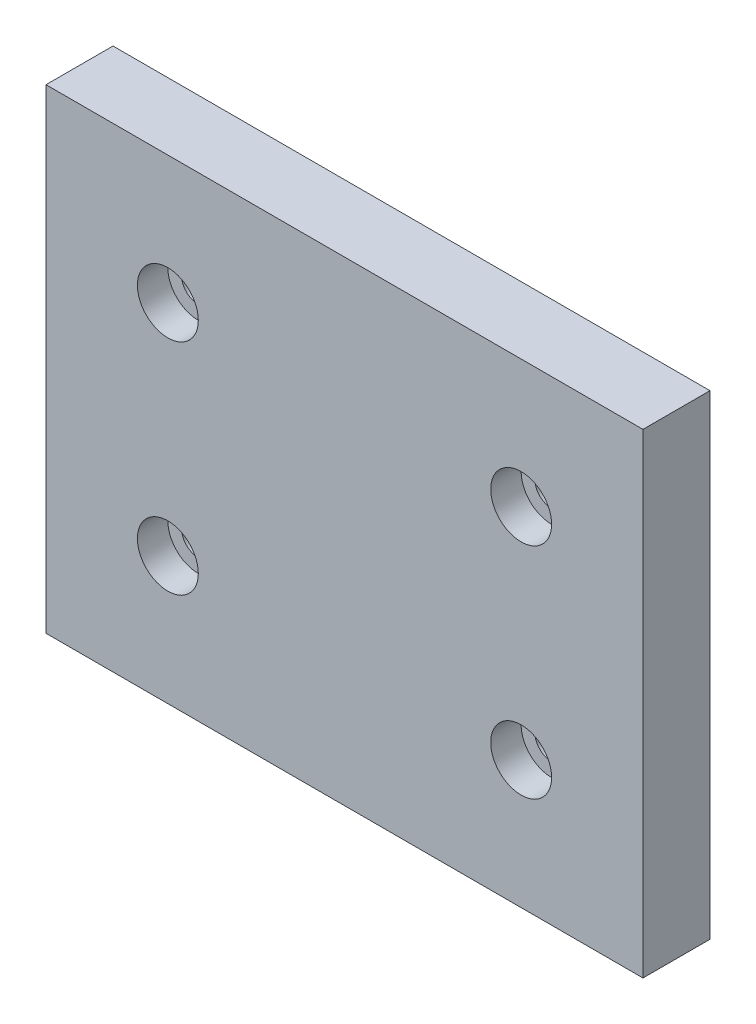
ISO-10303-21;
HEADER;
FILE_DESCRIPTION(('STEP AP214'),'2;1');
FILE_NAME('part.step','',(''),(''),'','','');
FILE_SCHEMA(('AUTOMOTIVE_DESIGN { 1 0 10303 214 1 1 1 1 }'));
ENDSEC;
DATA;
#1=APPLICATION_CONTEXT('core data for automotive mechanical design processes');
#2=APPLICATION_PROTOCOL_DEFINITION('international standard','automotive_design',2000,#1);
#3=PRODUCT_CONTEXT('',#1,'mechanical');
#4=PRODUCT('Part','Part','',(#3));
#5=PRODUCT_RELATED_PRODUCT_CATEGORY('part','',(#4));
#6=PRODUCT_DEFINITION_FORMATION('','',#4);
#7=PRODUCT_DEFINITION_CONTEXT('part definition',#1,'design');
#8=PRODUCT_DEFINITION('design','',#6,#7);
#9=PRODUCT_DEFINITION_SHAPE('','',#8);
#10=(LENGTH_UNIT() NAMED_UNIT(*) SI_UNIT(.MILLI.,.METRE.));
#11=(NAMED_UNIT(*) PLANE_ANGLE_UNIT() SI_UNIT($,.RADIAN.));
#12=(NAMED_UNIT(*) SI_UNIT($,.STERADIAN.) SOLID_ANGLE_UNIT());
#13=UNCERTAINTY_MEASURE_WITH_UNIT(LENGTH_MEASURE(1.E-05),#10,'distance_accuracy_value','');
#14=(GEOMETRIC_REPRESENTATION_CONTEXT(3) GLOBAL_UNCERTAINTY_ASSIGNED_CONTEXT((#13)) GLOBAL_UNIT_ASSIGNED_CONTEXT((#10,
#11,#12)) REPRESENTATION_CONTEXT('',''));
#15=CARTESIAN_POINT('',(0.,0.,0.));
#16=DIRECTION('',(0.,0.,1.));
#17=DIRECTION('',(1.,0.,0.));
#18=AXIS2_PLACEMENT_3D('',#15,#16,#17);
#19=CARTESIAN_POINT('',(-49.,39.,11.));
#20=DIRECTION('',(1.,0.,0.));
#21=DIRECTION('',(0.,1.,0.));
#22=AXIS2_PLACEMENT_3D('',#19,#20,#21);
#23=PLANE('',#22);
#24=DIRECTION('',(0.,-1.,0.));
#25=VECTOR('',#24,1.);
#26=CARTESIAN_POINT('',(-49.,39.,0.));
#27=LINE('',#26,#25);
#28=CARTESIAN_POINT('',(-49.,39.,0.));
#29=VERTEX_POINT('',#28);
#30=CARTESIAN_POINT('',(-49.,-39.,0.));
#31=VERTEX_POINT('',#30);
#32=EDGE_CURVE('E74',#29,#31,#27,.T.);
#33=ORIENTED_EDGE('',*,*,#32,.T.);
#34=DIRECTION('',(0.,0.,-1.));
#35=VECTOR('',#34,1.);
#36=CARTESIAN_POINT('',(-49.,-39.,11.));
#37=LINE('',#36,#35);
#38=CARTESIAN_POINT('',(-49.,-39.,11.));
#39=VERTEX_POINT('',#38);
#40=EDGE_CURVE('E11',#39,#31,#37,.T.);
#41=ORIENTED_EDGE('',*,*,#40,.F.);
#42=DIRECTION('',(0.,-1.,0.));
#43=VECTOR('',#42,1.);
#44=CARTESIAN_POINT('',(-49.,39.,11.));
#45=LINE('',#44,#43);
#46=CARTESIAN_POINT('',(-49.,39.,11.));
#47=VERTEX_POINT('',#46);
#48=EDGE_CURVE('E97',#47,#39,#45,.T.);
#49=ORIENTED_EDGE('',*,*,#48,.F.);
#50=DIRECTION('',(0.,0.,-1.));
#51=VECTOR('',#50,1.);
#52=CARTESIAN_POINT('',(-49.,39.,11.));
#53=LINE('',#52,#51);
#54=EDGE_CURVE('E86',#47,#29,#53,.T.);
#55=ORIENTED_EDGE('',*,*,#54,.T.);
#56=EDGE_LOOP('',(#33,#41,#49,#55));
#57=FACE_BOUND('',#56,.T.);
#58=ADVANCED_FACE('F30',(#57),#23,.F.);
#59=CARTESIAN_POINT('',(-49.,-39.,11.));
#60=DIRECTION('',(0.,1.,0.));
#61=DIRECTION('',(-1.,0.,0.));
#62=AXIS2_PLACEMENT_3D('',#59,#60,#61);
#63=PLANE('',#62);
#64=DIRECTION('',(1.,0.,0.));
#65=VECTOR('',#64,1.);
#66=CARTESIAN_POINT('',(-49.,-39.,0.));
#67=LINE('',#66,#65);
#68=CARTESIAN_POINT('',(49.,-39.,0.));
#69=VERTEX_POINT('',#68);
#70=EDGE_CURVE('E70',#31,#69,#67,.T.);
#71=ORIENTED_EDGE('',*,*,#70,.T.);
#72=DIRECTION('',(0.,0.,-1.));
#73=VECTOR('',#72,1.);
#74=CARTESIAN_POINT('',(49.,-39.,11.));
#75=LINE('',#74,#73);
#76=CARTESIAN_POINT('',(49.,-39.,11.));
#77=VERTEX_POINT('',#76);
#78=EDGE_CURVE('E37',#77,#69,#75,.T.);
#79=ORIENTED_EDGE('',*,*,#78,.F.);
#80=DIRECTION('',(1.,0.,0.));
#81=VECTOR('',#80,1.);
#82=CARTESIAN_POINT('',(-49.,-39.,11.));
#83=LINE('',#82,#81);
#84=EDGE_CURVE('E82',#39,#77,#83,.T.);
#85=ORIENTED_EDGE('',*,*,#84,.F.);
#86=ORIENTED_EDGE('',*,*,#40,.T.);
#87=EDGE_LOOP('',(#71,#79,#85,#86));
#88=FACE_BOUND('',#87,.T.);
#89=ADVANCED_FACE('F81',(#88),#63,.F.);
#90=CARTESIAN_POINT('',(49.,39.,11.));
#91=DIRECTION('',(-1.,0.,0.));
#92=DIRECTION('',(0.,-1.,0.));
#93=AXIS2_PLACEMENT_3D('',#90,#91,#92);
#94=PLANE('',#93);
#95=DIRECTION('',(0.,1.,0.));
#96=VECTOR('',#95,1.);
#97=CARTESIAN_POINT('',(49.,39.,0.));
#98=LINE('',#97,#96);
#99=CARTESIAN_POINT('',(49.,39.,0.));
#100=VERTEX_POINT('',#99);
#101=EDGE_CURVE('E75',#69,#100,#98,.T.);
#102=ORIENTED_EDGE('',*,*,#101,.T.);
#103=DIRECTION('',(0.,0.,-1.));
#104=VECTOR('',#103,1.);
#105=CARTESIAN_POINT('',(49.,39.,11.));
#106=LINE('',#105,#104);
#107=CARTESIAN_POINT('',(49.,39.,11.));
#108=VERTEX_POINT('',#107);
#109=EDGE_CURVE('E103',#108,#100,#106,.T.);
#110=ORIENTED_EDGE('',*,*,#109,.F.);
#111=DIRECTION('',(0.,1.,0.));
#112=VECTOR('',#111,1.);
#113=CARTESIAN_POINT('',(49.,39.,11.));
#114=LINE('',#113,#112);
#115=EDGE_CURVE('E49',#77,#108,#114,.T.);
#116=ORIENTED_EDGE('',*,*,#115,.F.);
#117=ORIENTED_EDGE('',*,*,#78,.T.);
#118=EDGE_LOOP('',(#102,#110,#116,#117));
#119=FACE_BOUND('',#118,.T.);
#120=ADVANCED_FACE('F106',(#119),#94,.F.);
#121=CARTESIAN_POINT('',(-49.,39.,11.));
#122=DIRECTION('',(0.,-1.,0.));
#123=DIRECTION('',(1.,0.,0.));
#124=AXIS2_PLACEMENT_3D('',#121,#122,#123);
#125=PLANE('',#124);
#126=DIRECTION('',(-1.,0.,0.));
#127=VECTOR('',#126,1.);
#128=CARTESIAN_POINT('',(-49.,39.,0.));
#129=LINE('',#128,#127);
#130=EDGE_CURVE('E95',#100,#29,#129,.T.);
#131=ORIENTED_EDGE('',*,*,#130,.T.);
#132=ORIENTED_EDGE('',*,*,#54,.F.);
#133=DIRECTION('',(-1.,0.,0.));
#134=VECTOR('',#133,1.);
#135=CARTESIAN_POINT('',(-49.,39.,11.));
#136=LINE('',#135,#134);
#137=EDGE_CURVE('E44',#108,#47,#136,.T.);
#138=ORIENTED_EDGE('',*,*,#137,.F.);
#139=ORIENTED_EDGE('',*,*,#109,.T.);
#140=EDGE_LOOP('',(#131,#132,#138,#139));
#141=FACE_BOUND('',#140,.T.);
#142=ADVANCED_FACE('F108',(#141),#125,.F.);
#143=CARTESIAN_POINT('',(-49.,-39.,11.));
#144=DIRECTION('',(0.,0.,1.));
#145=DIRECTION('',(1.,0.,0.));
#146=AXIS2_PLACEMENT_3D('',#143,#144,#145);
#147=PLANE('',#146);
#148=CARTESIAN_POINT('',(-29.,18.,11.));
#149=DIRECTION('',(0.,0.,1.));
#150=DIRECTION('',(1.,0.,0.));
#151=AXIS2_PLACEMENT_3D('',#148,#149,#150);
#152=CIRCLE('',#151,4.99999999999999);
#153=CARTESIAN_POINT('',(-24.,18.,11.));
#154=VERTEX_POINT('',#153);
#155=EDGE_CURVE('E280',#154,#154,#152,.T.);
#156=ORIENTED_EDGE('',*,*,#155,.F.);
#157=EDGE_LOOP('',(#156));
#158=FACE_BOUND('',#157,.T.);
#159=CARTESIAN_POINT('',(29.,18.,11.));
#160=DIRECTION('',(0.,0.,1.));
#161=DIRECTION('',(1.,0.,0.));
#162=AXIS2_PLACEMENT_3D('',#159,#160,#161);
#163=CIRCLE('',#162,4.99999999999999);
#164=CARTESIAN_POINT('',(34.,18.,11.));
#165=VERTEX_POINT('',#164);
#166=EDGE_CURVE('E295',#165,#165,#163,.T.);
#167=ORIENTED_EDGE('',*,*,#166,.F.);
#168=EDGE_LOOP('',(#167));
#169=FACE_BOUND('',#168,.T.);
#170=CARTESIAN_POINT('',(29.,-18.,11.));
#171=DIRECTION('',(0.,0.,1.));
#172=DIRECTION('',(1.,0.,0.));
#173=AXIS2_PLACEMENT_3D('',#170,#171,#172);
#174=CIRCLE('',#173,4.99999999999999);
#175=CARTESIAN_POINT('',(34.,-18.,11.));
#176=VERTEX_POINT('',#175);
#177=EDGE_CURVE('E307',#176,#176,#174,.T.);
#178=ORIENTED_EDGE('',*,*,#177,.F.);
#179=EDGE_LOOP('',(#178));
#180=FACE_BOUND('',#179,.T.);
#181=CARTESIAN_POINT('',(-29.,-18.,11.));
#182=DIRECTION('',(0.,0.,1.));
#183=DIRECTION('',(1.,0.,0.));
#184=AXIS2_PLACEMENT_3D('',#181,#182,#183);
#185=CIRCLE('',#184,4.99999999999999);
#186=CARTESIAN_POINT('',(-24.,-18.,11.));
#187=VERTEX_POINT('',#186);
#188=EDGE_CURVE('E87',#187,#187,#185,.T.);
#189=ORIENTED_EDGE('',*,*,#188,.F.);
#190=EDGE_LOOP('',(#189));
#191=FACE_BOUND('',#190,.T.);
#192=ORIENTED_EDGE('',*,*,#48,.T.);
#193=ORIENTED_EDGE('',*,*,#84,.T.);
#194=ORIENTED_EDGE('',*,*,#115,.T.);
#195=ORIENTED_EDGE('',*,*,#137,.T.);
#196=EDGE_LOOP('',(#192,#193,#194,#195));
#197=FACE_BOUND('',#196,.T.);
#198=ADVANCED_FACE('F109',(#158,#169,#180,#191,#197),#147,.T.);
#199=CARTESIAN_POINT('',(-49.,-39.,0.));
#200=DIRECTION('',(0.,0.,1.));
#201=DIRECTION('',(1.,0.,0.));
#202=AXIS2_PLACEMENT_3D('',#199,#200,#201);
#203=PLANE('',#202);
#204=CARTESIAN_POINT('',(-29.,18.,0.));
#205=DIRECTION('',(0.,0.,1.));
#206=DIRECTION('',(1.,0.,0.));
#207=AXIS2_PLACEMENT_3D('',#204,#205,#206);
#208=CIRCLE('',#207,2.75);
#209=CARTESIAN_POINT('',(-26.25,18.,0.));
#210=VERTEX_POINT('',#209);
#211=EDGE_CURVE('E273',#210,#210,#208,.T.);
#212=ORIENTED_EDGE('',*,*,#211,.T.);
#213=EDGE_LOOP('',(#212));
#214=FACE_BOUND('',#213,.T.);
#215=CARTESIAN_POINT('',(29.,18.,0.));
#216=DIRECTION('',(0.,0.,1.));
#217=DIRECTION('',(1.,0.,0.));
#218=AXIS2_PLACEMENT_3D('',#215,#216,#217);
#219=CIRCLE('',#218,2.75);
#220=CARTESIAN_POINT('',(31.75,18.,0.));
#221=VERTEX_POINT('',#220);
#222=EDGE_CURVE('E286',#221,#221,#219,.T.);
#223=ORIENTED_EDGE('',*,*,#222,.T.);
#224=EDGE_LOOP('',(#223));
#225=FACE_BOUND('',#224,.T.);
#226=CARTESIAN_POINT('',(29.,-18.,0.));
#227=DIRECTION('',(0.,0.,1.));
#228=DIRECTION('',(1.,0.,0.));
#229=AXIS2_PLACEMENT_3D('',#226,#227,#228);
#230=CIRCLE('',#229,2.75);
#231=CARTESIAN_POINT('',(31.75,-18.,0.));
#232=VERTEX_POINT('',#231);
#233=EDGE_CURVE('E298',#232,#232,#230,.T.);
#234=ORIENTED_EDGE('',*,*,#233,.T.);
#235=EDGE_LOOP('',(#234));
#236=FACE_BOUND('',#235,.T.);
#237=CARTESIAN_POINT('',(-29.,-18.,0.));
#238=DIRECTION('',(0.,0.,1.));
#239=DIRECTION('',(1.,0.,0.));
#240=AXIS2_PLACEMENT_3D('',#237,#238,#239);
#241=CIRCLE('',#240,2.75);
#242=CARTESIAN_POINT('',(-26.25,-18.,0.));
#243=VERTEX_POINT('',#242);
#244=EDGE_CURVE('E310',#243,#243,#241,.T.);
#245=ORIENTED_EDGE('',*,*,#244,.T.);
#246=EDGE_LOOP('',(#245));
#247=FACE_BOUND('',#246,.T.);
#248=ORIENTED_EDGE('',*,*,#32,.F.);
#249=ORIENTED_EDGE('',*,*,#130,.F.);
#250=ORIENTED_EDGE('',*,*,#101,.F.);
#251=ORIENTED_EDGE('',*,*,#70,.F.);
#252=EDGE_LOOP('',(#248,#249,#250,#251));
#253=FACE_BOUND('',#252,.T.);
#254=ADVANCED_FACE('F71',(#214,#225,#236,#247,#253),#203,.F.);
#255=CARTESIAN_POINT('',(-29.,-18.,11.));
#256=DIRECTION('',(0.,0.,1.));
#257=DIRECTION('',(1.,0.,0.));
#258=AXIS2_PLACEMENT_3D('',#255,#256,#257);
#259=CYLINDRICAL_SURFACE('',#258,4.99999999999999);
#260=CARTESIAN_POINT('',(-29.,-18.,5.99999999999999));
#261=DIRECTION('',(0.,0.,1.));
#262=DIRECTION('',(1.,0.,0.));
#263=AXIS2_PLACEMENT_3D('',#260,#261,#262);
#264=CIRCLE('',#263,4.99999999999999);
#265=CARTESIAN_POINT('',(-24.,-18.,5.99999999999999));
#266=VERTEX_POINT('',#265);
#267=EDGE_CURVE('E90',#266,#266,#264,.T.);
#268=ORIENTED_EDGE('',*,*,#267,.F.);
#269=EDGE_LOOP('',(#268));
#270=FACE_BOUND('',#269,.T.);
#271=ORIENTED_EDGE('',*,*,#188,.T.);
#272=EDGE_LOOP('',(#271));
#273=FACE_BOUND('',#272,.T.);
#274=ADVANCED_FACE('F117',(#270,#273),#259,.F.);
#275=CARTESIAN_POINT('',(-26.25,-18.,5.99999999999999));
#276=DIRECTION('',(0.,0.,-1.));
#277=DIRECTION('',(-1.,0.,0.));
#278=AXIS2_PLACEMENT_3D('',#275,#276,#277);
#279=PLANE('',#278);
#280=CARTESIAN_POINT('',(-29.,-18.,5.99999999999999));
#281=DIRECTION('',(0.,0.,1.));
#282=DIRECTION('',(1.,0.,0.));
#283=AXIS2_PLACEMENT_3D('',#280,#281,#282);
#284=CIRCLE('',#283,2.75000000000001);
#285=CARTESIAN_POINT('',(-26.25,-18.,5.99999999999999));
#286=VERTEX_POINT('',#285);
#287=EDGE_CURVE('E313',#286,#286,#284,.T.);
#288=ORIENTED_EDGE('',*,*,#287,.F.);
#289=EDGE_LOOP('',(#288));
#290=FACE_BOUND('',#289,.T.);
#291=ORIENTED_EDGE('',*,*,#267,.T.);
#292=EDGE_LOOP('',(#291));
#293=FACE_BOUND('',#292,.T.);
#294=ADVANCED_FACE('F156',(#290,#293),#279,.F.);
#295=CARTESIAN_POINT('',(-29.,-18.,11.));
#296=DIRECTION('',(0.,0.,1.));
#297=DIRECTION('',(1.,0.,0.));
#298=AXIS2_PLACEMENT_3D('',#295,#296,#297);
#299=CYLINDRICAL_SURFACE('',#298,2.75);
#300=ORIENTED_EDGE('',*,*,#244,.F.);
#301=EDGE_LOOP('',(#300));
#302=FACE_BOUND('',#301,.T.);
#303=ORIENTED_EDGE('',*,*,#287,.T.);
#304=EDGE_LOOP('',(#303));
#305=FACE_BOUND('',#304,.T.);
#306=ADVANCED_FACE('F166',(#302,#305),#299,.F.);
#307=CARTESIAN_POINT('',(29.,-18.,11.));
#308=DIRECTION('',(0.,0.,1.));
#309=DIRECTION('',(1.,0.,0.));
#310=AXIS2_PLACEMENT_3D('',#307,#308,#309);
#311=CYLINDRICAL_SURFACE('',#310,4.99999999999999);
#312=CARTESIAN_POINT('',(29.,-18.,5.99999999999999));
#313=DIRECTION('',(0.,0.,1.));
#314=DIRECTION('',(1.,0.,0.));
#315=AXIS2_PLACEMENT_3D('',#312,#313,#314);
#316=CIRCLE('',#315,4.99999999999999);
#317=CARTESIAN_POINT('',(34.,-18.,5.99999999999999));
#318=VERTEX_POINT('',#317);
#319=EDGE_CURVE('E304',#318,#318,#316,.T.);
#320=ORIENTED_EDGE('',*,*,#319,.F.);
#321=EDGE_LOOP('',(#320));
#322=FACE_BOUND('',#321,.T.);
#323=ORIENTED_EDGE('',*,*,#177,.T.);
#324=EDGE_LOOP('',(#323));
#325=FACE_BOUND('',#324,.T.);
#326=ADVANCED_FACE('F176',(#322,#325),#311,.F.);
#327=CARTESIAN_POINT('',(31.75,-18.,5.99999999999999));
#328=DIRECTION('',(0.,0.,-1.));
#329=DIRECTION('',(-1.,0.,0.));
#330=AXIS2_PLACEMENT_3D('',#327,#328,#329);
#331=PLANE('',#330);
#332=CARTESIAN_POINT('',(29.,-18.,5.99999999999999));
#333=DIRECTION('',(0.,0.,1.));
#334=DIRECTION('',(1.,0.,0.));
#335=AXIS2_PLACEMENT_3D('',#332,#333,#334);
#336=CIRCLE('',#335,2.75000000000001);
#337=CARTESIAN_POINT('',(31.75,-18.,5.99999999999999));
#338=VERTEX_POINT('',#337);
#339=EDGE_CURVE('E301',#338,#338,#336,.T.);
#340=ORIENTED_EDGE('',*,*,#339,.F.);
#341=EDGE_LOOP('',(#340));
#342=FACE_BOUND('',#341,.T.);
#343=ORIENTED_EDGE('',*,*,#319,.T.);
#344=EDGE_LOOP('',(#343));
#345=FACE_BOUND('',#344,.T.);
#346=ADVANCED_FACE('F186',(#342,#345),#331,.F.);
#347=CARTESIAN_POINT('',(29.,-18.,11.));
#348=DIRECTION('',(0.,0.,1.));
#349=DIRECTION('',(1.,0.,0.));
#350=AXIS2_PLACEMENT_3D('',#347,#348,#349);
#351=CYLINDRICAL_SURFACE('',#350,2.75);
#352=ORIENTED_EDGE('',*,*,#233,.F.);
#353=EDGE_LOOP('',(#352));
#354=FACE_BOUND('',#353,.T.);
#355=ORIENTED_EDGE('',*,*,#339,.T.);
#356=EDGE_LOOP('',(#355));
#357=FACE_BOUND('',#356,.T.);
#358=ADVANCED_FACE('F196',(#354,#357),#351,.F.);
#359=CARTESIAN_POINT('',(29.,18.,11.));
#360=DIRECTION('',(0.,0.,1.));
#361=DIRECTION('',(1.,0.,0.));
#362=AXIS2_PLACEMENT_3D('',#359,#360,#361);
#363=CYLINDRICAL_SURFACE('',#362,4.99999999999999);
#364=CARTESIAN_POINT('',(29.,18.,5.99999999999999));
#365=DIRECTION('',(0.,0.,1.));
#366=DIRECTION('',(1.,0.,0.));
#367=AXIS2_PLACEMENT_3D('',#364,#365,#366);
#368=CIRCLE('',#367,4.99999999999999);
#369=CARTESIAN_POINT('',(34.,18.,5.99999999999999));
#370=VERTEX_POINT('',#369);
#371=EDGE_CURVE('E292',#370,#370,#368,.T.);
#372=ORIENTED_EDGE('',*,*,#371,.F.);
#373=EDGE_LOOP('',(#372));
#374=FACE_BOUND('',#373,.T.);
#375=ORIENTED_EDGE('',*,*,#166,.T.);
#376=EDGE_LOOP('',(#375));
#377=FACE_BOUND('',#376,.T.);
#378=ADVANCED_FACE('F206',(#374,#377),#363,.F.);
#379=CARTESIAN_POINT('',(31.75,18.,5.99999999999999));
#380=DIRECTION('',(0.,0.,-1.));
#381=DIRECTION('',(-1.,0.,0.));
#382=AXIS2_PLACEMENT_3D('',#379,#380,#381);
#383=PLANE('',#382);
#384=CARTESIAN_POINT('',(29.,18.,5.99999999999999));
#385=DIRECTION('',(0.,0.,1.));
#386=DIRECTION('',(1.,0.,0.));
#387=AXIS2_PLACEMENT_3D('',#384,#385,#386);
#388=CIRCLE('',#387,2.75000000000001);
#389=CARTESIAN_POINT('',(31.75,18.,5.99999999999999));
#390=VERTEX_POINT('',#389);
#391=EDGE_CURVE('E289',#390,#390,#388,.T.);
#392=ORIENTED_EDGE('',*,*,#391,.F.);
#393=EDGE_LOOP('',(#392));
#394=FACE_BOUND('',#393,.T.);
#395=ORIENTED_EDGE('',*,*,#371,.T.);
#396=EDGE_LOOP('',(#395));
#397=FACE_BOUND('',#396,.T.);
#398=ADVANCED_FACE('F216',(#394,#397),#383,.F.);
#399=CARTESIAN_POINT('',(29.,18.,11.));
#400=DIRECTION('',(0.,0.,1.));
#401=DIRECTION('',(1.,0.,0.));
#402=AXIS2_PLACEMENT_3D('',#399,#400,#401);
#403=CYLINDRICAL_SURFACE('',#402,2.75);
#404=ORIENTED_EDGE('',*,*,#222,.F.);
#405=EDGE_LOOP('',(#404));
#406=FACE_BOUND('',#405,.T.);
#407=ORIENTED_EDGE('',*,*,#391,.T.);
#408=EDGE_LOOP('',(#407));
#409=FACE_BOUND('',#408,.T.);
#410=ADVANCED_FACE('F226',(#406,#409),#403,.F.);
#411=CARTESIAN_POINT('',(-29.,18.,11.));
#412=DIRECTION('',(0.,0.,1.));
#413=DIRECTION('',(1.,0.,0.));
#414=AXIS2_PLACEMENT_3D('',#411,#412,#413);
#415=CYLINDRICAL_SURFACE('',#414,4.99999999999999);
#416=CARTESIAN_POINT('',(-29.,18.,5.99999999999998));
#417=DIRECTION('',(0.,0.,1.));
#418=DIRECTION('',(1.,0.,0.));
#419=AXIS2_PLACEMENT_3D('',#416,#417,#418);
#420=CIRCLE('',#419,4.99999999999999);
#421=CARTESIAN_POINT('',(-24.,18.,5.99999999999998));
#422=VERTEX_POINT('',#421);
#423=EDGE_CURVE('E277',#422,#422,#420,.T.);
#424=ORIENTED_EDGE('',*,*,#423,.F.);
#425=EDGE_LOOP('',(#424));
#426=FACE_BOUND('',#425,.T.);
#427=ORIENTED_EDGE('',*,*,#155,.T.);
#428=EDGE_LOOP('',(#427));
#429=FACE_BOUND('',#428,.T.);
#430=ADVANCED_FACE('F236',(#426,#429),#415,.F.);
#431=CARTESIAN_POINT('',(-26.25,18.,5.99999999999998));
#432=DIRECTION('',(0.,0.,-1.));
#433=DIRECTION('',(-1.,0.,0.));
#434=AXIS2_PLACEMENT_3D('',#431,#432,#433);
#435=PLANE('',#434);
#436=CARTESIAN_POINT('',(-29.,18.,5.99999999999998));
#437=DIRECTION('',(0.,0.,1.));
#438=DIRECTION('',(1.,0.,0.));
#439=AXIS2_PLACEMENT_3D('',#436,#437,#438);
#440=CIRCLE('',#439,2.75000000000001);
#441=CARTESIAN_POINT('',(-26.25,18.,5.99999999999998));
#442=VERTEX_POINT('',#441);
#443=EDGE_CURVE('E276',#442,#442,#440,.T.);
#444=ORIENTED_EDGE('',*,*,#443,.F.);
#445=EDGE_LOOP('',(#444));
#446=FACE_BOUND('',#445,.T.);
#447=ORIENTED_EDGE('',*,*,#423,.T.);
#448=EDGE_LOOP('',(#447));
#449=FACE_BOUND('',#448,.T.);
#450=ADVANCED_FACE('F246',(#446,#449),#435,.F.);
#451=CARTESIAN_POINT('',(-29.,18.,11.));
#452=DIRECTION('',(0.,0.,1.));
#453=DIRECTION('',(1.,0.,0.));
#454=AXIS2_PLACEMENT_3D('',#451,#452,#453);
#455=CYLINDRICAL_SURFACE('',#454,2.75);
#456=ORIENTED_EDGE('',*,*,#211,.F.);
#457=EDGE_LOOP('',(#456));
#458=FACE_BOUND('',#457,.T.);
#459=ORIENTED_EDGE('',*,*,#443,.T.);
#460=EDGE_LOOP('',(#459));
#461=FACE_BOUND('',#460,.T.);
#462=ADVANCED_FACE('F256',(#458,#461),#455,.F.);
#463=CLOSED_SHELL('',(#58,#89,#120,#142,#198,#254,#274,#294,#306,#326,#346,#358,#378,#398,#410,
#430,#450,#462));
#464=MANIFOLD_SOLID_BREP('B2',#463);
#465=ADVANCED_BREP_SHAPE_REPRESENTATION('',(#18,#464),#14);
#466=SHAPE_DEFINITION_REPRESENTATION(#9,#465);
ENDSEC;
END-ISO-10303-21;
